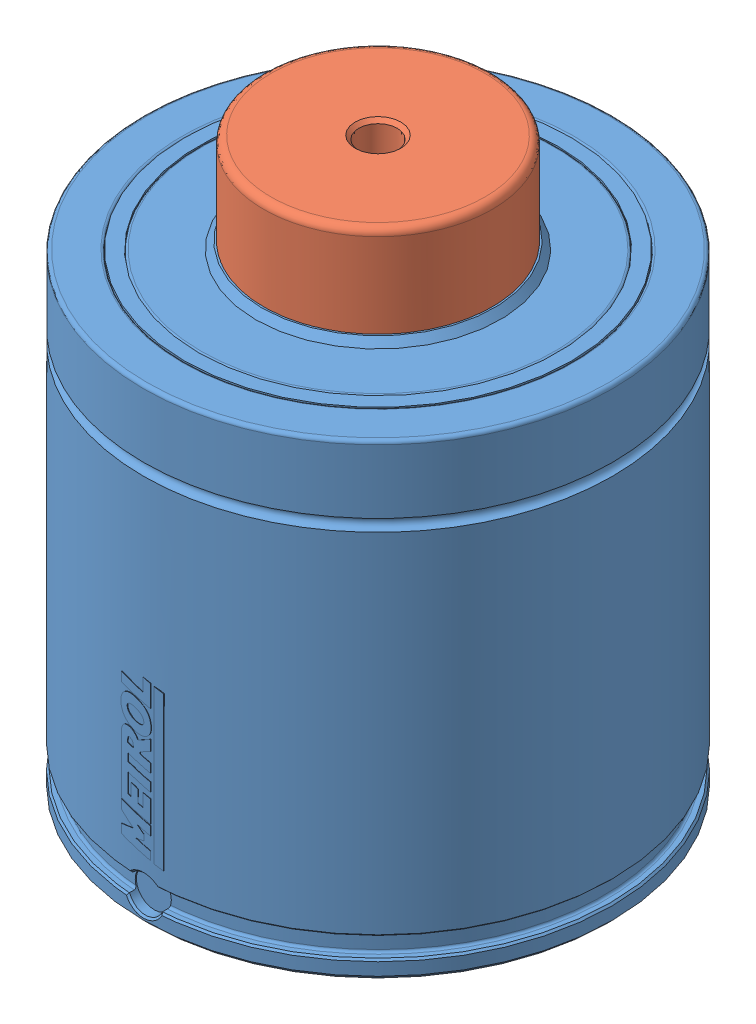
SolidWorks assembly ISNG10000-038.SLDASM, configuration Default (file format 7000). Lengths in mm.
Overall size (195 236 195.11).
2 component instances, 2 part files, 6 mates.
Components (placement in the parent):
- ISNG10000 Body-1: ISNG10000 Body.SLDPRT [ISNG10000-038] x (0 0 1) z (0 -1 0) size (195.11 195 197.9)
- ISNG10000 Piston-1: ISNG10000 Piston.SLDPRT [ISNG-10000-38.1] at (0 169.9 0) x (-1 0 0) z (0 -1 0) size (115 115 66.1)
Mates (geometry in assembly coordinates):
- Concentric1: concentric aligned: cylinder of ISNG10000 Body-1 through (0 0 0) axis (0 -1 0) radius 47.5; cylinder of ISNG10000 Piston-1 through (0 169.9 0) axis (0 -1 0) radius 47.5
- Coincident1: coincident anti-aligned: plane of ISNG10000 Body-1 through (0 0 0) normal (0 -1 0); plane of assembly through (0 0 0) normal (0 1 0)
- Coincident2: coincident anti-aligned: plane of ISNG10000 Body-1; plane of assembly through (0 0 0) normal (1 0 0)
- Coincident3: coincident aligned: plane of ISNG10000 Body-1; plane of assembly through (0 0 0) normal (0 0 1)
- Coincident4: coincident anti-aligned: plane of ISNG10000 Piston-1; plane of assembly through (0 0 0) normal (0 0 1)
- LimitDistance1: limit distance = 41.1 mm aligned: plane of ISNG10000 Piston-1 through (0 236 -44.5) normal (0 1 0); plane of ISNG10000 Body-1 through (-73.5 194.9 0) normal (0 1 0)
